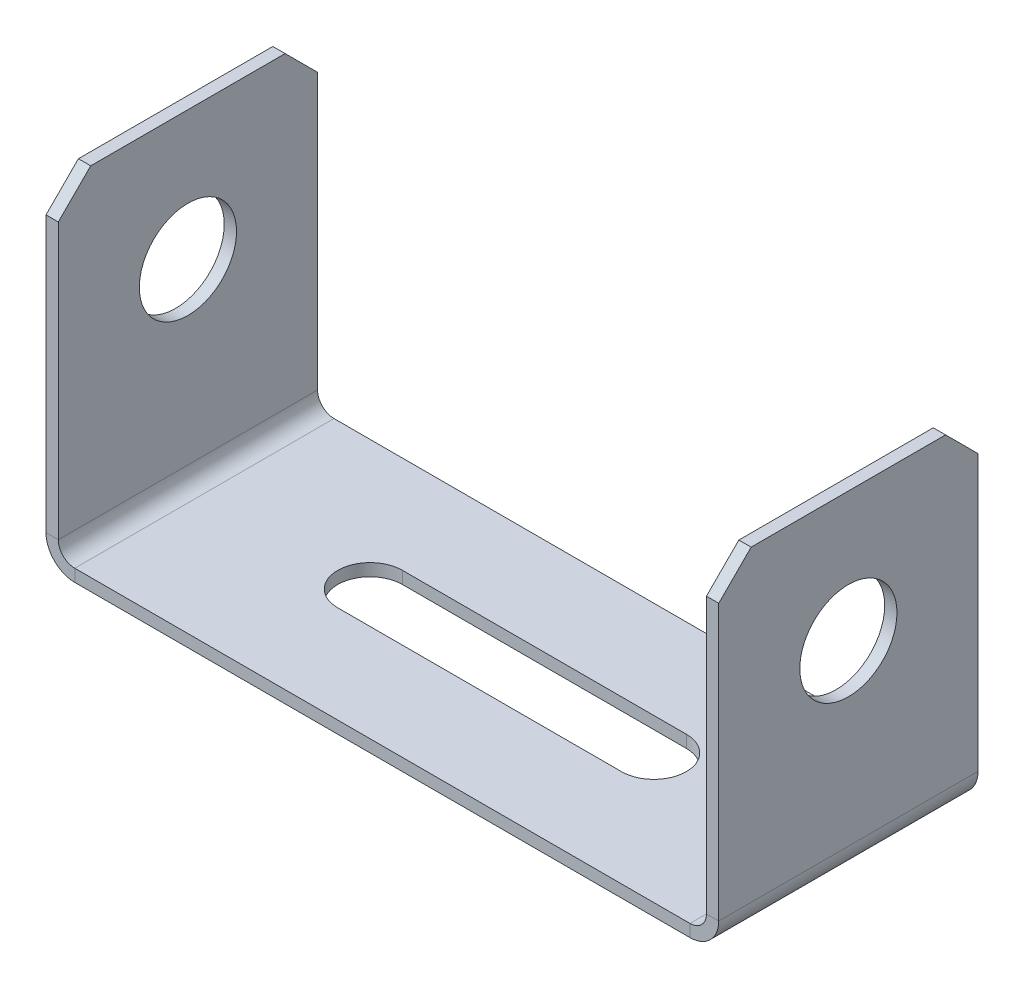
ISO-10303-21;
HEADER;
FILE_DESCRIPTION(('STEP AP214'),'2;1');
FILE_NAME('part.step','',(''),(''),'','','');
FILE_SCHEMA(('AUTOMOTIVE_DESIGN { 1 0 10303 214 1 1 1 1 }'));
ENDSEC;
DATA;
#1=APPLICATION_CONTEXT('core data for automotive mechanical design processes');
#2=APPLICATION_PROTOCOL_DEFINITION('international standard','automotive_design',2000,#1);
#3=PRODUCT_CONTEXT('',#1,'mechanical');
#4=PRODUCT('Part','Part','',(#3));
#5=PRODUCT_RELATED_PRODUCT_CATEGORY('part','',(#4));
#6=PRODUCT_DEFINITION_FORMATION('','',#4);
#7=PRODUCT_DEFINITION_CONTEXT('part definition',#1,'design');
#8=PRODUCT_DEFINITION('design','',#6,#7);
#9=PRODUCT_DEFINITION_SHAPE('','',#8);
#10=(LENGTH_UNIT() NAMED_UNIT(*) SI_UNIT(.MILLI.,.METRE.));
#11=(NAMED_UNIT(*) PLANE_ANGLE_UNIT() SI_UNIT($,.RADIAN.));
#12=(NAMED_UNIT(*) SI_UNIT($,.STERADIAN.) SOLID_ANGLE_UNIT());
#13=UNCERTAINTY_MEASURE_WITH_UNIT(LENGTH_MEASURE(1.E-05),#10,'distance_accuracy_value','');
#14=(GEOMETRIC_REPRESENTATION_CONTEXT(3) GLOBAL_UNCERTAINTY_ASSIGNED_CONTEXT((#13)) GLOBAL_UNIT_ASSIGNED_CONTEXT((#10,
#11,#12)) REPRESENTATION_CONTEXT('',''));
#15=CARTESIAN_POINT('',(0.,0.,0.));
#16=DIRECTION('',(0.,0.,1.));
#17=DIRECTION('',(1.,0.,0.));
#18=AXIS2_PLACEMENT_3D('',#15,#16,#17);
#19=CARTESIAN_POINT('',(-47.46,0.,20.));
#20=DIRECTION('',(0.,0.,1.));
#21=DIRECTION('',(1.,0.,0.));
#22=AXIS2_PLACEMENT_3D('',#19,#20,#21);
#23=PLANE('',#22);
#24=DIRECTION('',(0.,-1.,0.));
#25=VECTOR('',#24,1.);
#26=CARTESIAN_POINT('',(-47.46,0.,20.));
#27=LINE('',#26,#25);
#28=CARTESIAN_POINT('',(-47.46,0.,20.));
#29=VERTEX_POINT('',#28);
#30=CARTESIAN_POINT('',(-47.46,-1.89738,20.));
#31=VERTEX_POINT('',#30);
#32=EDGE_CURVE('E325',#29,#31,#27,.T.);
#33=ORIENTED_EDGE('',*,*,#32,.F.);
#34=CARTESIAN_POINT('',(-47.46,2.54,20.));
#35=DIRECTION('',(0.,0.,-1.));
#36=DIRECTION('',(-1.,0.,0.));
#37=AXIS2_PLACEMENT_3D('',#34,#35,#36);
#38=CIRCLE('',#37,2.54);
#39=CARTESIAN_POINT('',(-50.,2.54,20.));
#40=VERTEX_POINT('',#39);
#41=EDGE_CURVE('E246',#29,#40,#38,.T.);
#42=ORIENTED_EDGE('',*,*,#41,.T.);
#43=DIRECTION('',(1.,0.,0.));
#44=VECTOR('',#43,1.);
#45=CARTESIAN_POINT('',(-51.89738,2.54,20.));
#46=LINE('',#45,#44);
#47=CARTESIAN_POINT('',(-51.89738,2.54,20.));
#48=VERTEX_POINT('',#47);
#49=EDGE_CURVE('E323',#48,#40,#46,.T.);
#50=ORIENTED_EDGE('',*,*,#49,.F.);
#51=CARTESIAN_POINT('',(-47.46,2.54,20.));
#52=DIRECTION('',(0.,0.,1.));
#53=DIRECTION('',(1.,0.,0.));
#54=AXIS2_PLACEMENT_3D('',#51,#52,#53);
#55=CIRCLE('',#54,4.43738);
#56=EDGE_CURVE('E227',#31,#48,#55,.F.);
#57=ORIENTED_EDGE('',*,*,#56,.F.);
#58=EDGE_LOOP('',(#33,#42,#50,#57));
#59=FACE_BOUND('',#58,.T.);
#60=ADVANCED_FACE('F36',(#59),#23,.T.);
#61=CARTESIAN_POINT('',(-51.89738,2.54,20.));
#62=DIRECTION('',(0.,0.,1.));
#63=DIRECTION('',(1.,0.,0.));
#64=AXIS2_PLACEMENT_3D('',#61,#62,#63);
#65=PLANE('',#64);
#66=DIRECTION('',(-1.,0.,0.));
#67=VECTOR('',#66,1.);
#68=CARTESIAN_POINT('',(-50.,0.,20.));
#69=LINE('',#68,#67);
#70=CARTESIAN_POINT('',(47.46,0.,20.));
#71=VERTEX_POINT('',#70);
#72=EDGE_CURVE('E243',#71,#29,#69,.T.);
#73=ORIENTED_EDGE('',*,*,#72,.T.);
#74=ORIENTED_EDGE('',*,*,#32,.T.);
#75=DIRECTION('',(1.,0.,0.));
#76=VECTOR('',#75,1.);
#77=CARTESIAN_POINT('',(-50.,-1.89738,20.));
#78=LINE('',#77,#76);
#79=CARTESIAN_POINT('',(47.46,-1.89738,20.));
#80=VERTEX_POINT('',#79);
#81=EDGE_CURVE('E230',#80,#31,#78,.F.);
#82=ORIENTED_EDGE('',*,*,#81,.F.);
#83=DIRECTION('',(0.,1.,0.));
#84=VECTOR('',#83,1.);
#85=CARTESIAN_POINT('',(47.46,-1.89738,20.));
#86=LINE('',#85,#84);
#87=EDGE_CURVE('E314',#80,#71,#86,.T.);
#88=ORIENTED_EDGE('',*,*,#87,.T.);
#89=EDGE_LOOP('',(#73,#74,#82,#88));
#90=FACE_BOUND('',#89,.T.);
#91=ADVANCED_FACE('F417',(#90),#65,.T.);
#92=CARTESIAN_POINT('',(-50.,2.54,-20.));
#93=DIRECTION('',(0.,0.,-1.));
#94=DIRECTION('',(-1.,0.,0.));
#95=AXIS2_PLACEMENT_3D('',#92,#93,#94);
#96=PLANE('',#95);
#97=DIRECTION('',(-1.,0.,0.));
#98=VECTOR('',#97,1.);
#99=CARTESIAN_POINT('',(-50.,2.54,-20.));
#100=LINE('',#99,#98);
#101=CARTESIAN_POINT('',(-50.,2.54,-20.));
#102=VERTEX_POINT('',#101);
#103=CARTESIAN_POINT('',(-51.89738,2.54,-20.));
#104=VERTEX_POINT('',#103);
#105=EDGE_CURVE('E321',#102,#104,#100,.T.);
#106=ORIENTED_EDGE('',*,*,#105,.F.);
#107=CARTESIAN_POINT('',(-47.46,2.54,-20.));
#108=DIRECTION('',(0.,0.,-1.));
#109=DIRECTION('',(-1.,0.,0.));
#110=AXIS2_PLACEMENT_3D('',#107,#108,#109);
#111=CIRCLE('',#110,2.54);
#112=CARTESIAN_POINT('',(-47.46,0.,-20.));
#113=VERTEX_POINT('',#112);
#114=EDGE_CURVE('E225',#113,#102,#111,.T.);
#115=ORIENTED_EDGE('',*,*,#114,.F.);
#116=DIRECTION('',(0.,1.,0.));
#117=VECTOR('',#116,1.);
#118=CARTESIAN_POINT('',(-47.46,-1.89738,-20.));
#119=LINE('',#118,#117);
#120=CARTESIAN_POINT('',(-47.46,-1.89738,-20.));
#121=VERTEX_POINT('',#120);
#122=EDGE_CURVE('E319',#121,#113,#119,.T.);
#123=ORIENTED_EDGE('',*,*,#122,.F.);
#124=CARTESIAN_POINT('',(-47.46,2.54,-20.));
#125=DIRECTION('',(0.,0.,1.));
#126=DIRECTION('',(1.,0.,0.));
#127=AXIS2_PLACEMENT_3D('',#124,#125,#126);
#128=CIRCLE('',#127,4.43738);
#129=EDGE_CURVE('E255',#121,#104,#128,.F.);
#130=ORIENTED_EDGE('',*,*,#129,.T.);
#131=EDGE_LOOP('',(#106,#115,#123,#130));
#132=FACE_BOUND('',#131,.T.);
#133=ADVANCED_FACE('F390',(#132),#96,.T.);
#134=CARTESIAN_POINT('',(-47.46,-1.89738,-20.));
#135=DIRECTION('',(0.,0.,-1.));
#136=DIRECTION('',(-1.,0.,0.));
#137=AXIS2_PLACEMENT_3D('',#134,#135,#136);
#138=PLANE('',#137);
#139=DIRECTION('',(0.,1.,0.));
#140=VECTOR('',#139,1.);
#141=CARTESIAN_POINT('',(-51.89738,50.,-20.));
#142=LINE('',#141,#140);
#143=CARTESIAN_POINT('',(-51.89738,45.,-20.));
#144=VERTEX_POINT('',#143);
#145=EDGE_CURVE('E252',#104,#144,#142,.T.);
#146=ORIENTED_EDGE('',*,*,#145,.T.);
#147=DIRECTION('',(1.,0.,0.));
#148=VECTOR('',#147,1.);
#149=CARTESIAN_POINT('',(-47.46,45.,-20.));
#150=LINE('',#149,#148);
#151=CARTESIAN_POINT('',(-50.,45.,-20.));
#152=VERTEX_POINT('',#151);
#153=EDGE_CURVE('E349',#144,#152,#150,.T.);
#154=ORIENTED_EDGE('',*,*,#153,.T.);
#155=DIRECTION('',(0.,1.,0.));
#156=VECTOR('',#155,1.);
#157=CARTESIAN_POINT('',(-50.,50.,-20.));
#158=LINE('',#157,#156);
#159=EDGE_CURVE('E218',#102,#152,#158,.T.);
#160=ORIENTED_EDGE('',*,*,#159,.F.);
#161=ORIENTED_EDGE('',*,*,#105,.T.);
#162=EDGE_LOOP('',(#146,#154,#160,#161));
#163=FACE_BOUND('',#162,.T.);
#164=ADVANCED_FACE('F369',(#163),#138,.T.);
#165=CARTESIAN_POINT('',(50.,2.54,20.));
#166=DIRECTION('',(0.,0.,1.));
#167=DIRECTION('',(1.,0.,0.));
#168=AXIS2_PLACEMENT_3D('',#165,#166,#167);
#169=PLANE('',#168);
#170=DIRECTION('',(1.,0.,0.));
#171=VECTOR('',#170,1.);
#172=CARTESIAN_POINT('',(50.,2.54,20.));
#173=LINE('',#172,#171);
#174=CARTESIAN_POINT('',(50.,2.54,20.));
#175=VERTEX_POINT('',#174);
#176=CARTESIAN_POINT('',(51.89738,2.54,20.));
#177=VERTEX_POINT('',#176);
#178=EDGE_CURVE('E316',#175,#177,#173,.T.);
#179=ORIENTED_EDGE('',*,*,#178,.F.);
#180=CARTESIAN_POINT('',(47.46,2.54,20.));
#181=DIRECTION('',(0.,0.,-1.));
#182=DIRECTION('',(-1.,0.,0.));
#183=AXIS2_PLACEMENT_3D('',#180,#181,#182);
#184=CIRCLE('',#183,2.54);
#185=EDGE_CURVE('E240',#175,#71,#184,.T.);
#186=ORIENTED_EDGE('',*,*,#185,.T.);
#187=ORIENTED_EDGE('',*,*,#87,.F.);
#188=CARTESIAN_POINT('',(47.46,2.54,20.));
#189=DIRECTION('',(0.,0.,1.));
#190=DIRECTION('',(1.,0.,0.));
#191=AXIS2_PLACEMENT_3D('',#188,#189,#190);
#192=CIRCLE('',#191,4.43738);
#193=EDGE_CURVE('E233',#177,#80,#192,.F.);
#194=ORIENTED_EDGE('',*,*,#193,.F.);
#195=EDGE_LOOP('',(#179,#186,#187,#194));
#196=FACE_BOUND('',#195,.T.);
#197=ADVANCED_FACE('F412',(#196),#169,.T.);
#198=CARTESIAN_POINT('',(47.46,-1.89738,20.));
#199=DIRECTION('',(0.,0.,1.));
#200=DIRECTION('',(1.,0.,0.));
#201=AXIS2_PLACEMENT_3D('',#198,#199,#200);
#202=PLANE('',#201);
#203=DIRECTION('',(0.,-1.,0.));
#204=VECTOR('',#203,1.);
#205=CARTESIAN_POINT('',(51.89738,50.,20.));
#206=LINE('',#205,#204);
#207=CARTESIAN_POINT('',(51.89738,45.,20.));
#208=VERTEX_POINT('',#207);
#209=EDGE_CURVE('E236',#208,#177,#206,.T.);
#210=ORIENTED_EDGE('',*,*,#209,.F.);
#211=DIRECTION('',(-1.,0.,0.));
#212=VECTOR('',#211,1.);
#213=CARTESIAN_POINT('',(47.46,45.,20.));
#214=LINE('',#213,#212);
#215=CARTESIAN_POINT('',(50.,45.,20.));
#216=VERTEX_POINT('',#215);
#217=EDGE_CURVE('E347',#208,#216,#214,.T.);
#218=ORIENTED_EDGE('',*,*,#217,.T.);
#219=DIRECTION('',(0.,-1.,0.));
#220=VECTOR('',#219,1.);
#221=CARTESIAN_POINT('',(50.,50.,20.));
#222=LINE('',#221,#220);
#223=EDGE_CURVE('E238',#216,#175,#222,.T.);
#224=ORIENTED_EDGE('',*,*,#223,.T.);
#225=ORIENTED_EDGE('',*,*,#178,.T.);
#226=EDGE_LOOP('',(#210,#218,#224,#225));
#227=FACE_BOUND('',#226,.T.);
#228=ADVANCED_FACE('F439',(#227),#202,.T.);
#229=CARTESIAN_POINT('',(47.46,0.,-20.));
#230=DIRECTION('',(0.,0.,-1.));
#231=DIRECTION('',(-1.,0.,0.));
#232=AXIS2_PLACEMENT_3D('',#229,#230,#231);
#233=PLANE('',#232);
#234=DIRECTION('',(0.,-1.,0.));
#235=VECTOR('',#234,1.);
#236=CARTESIAN_POINT('',(47.46,0.,-20.));
#237=LINE('',#236,#235);
#238=CARTESIAN_POINT('',(47.46,0.,-20.));
#239=VERTEX_POINT('',#238);
#240=CARTESIAN_POINT('',(47.46,-1.89738,-20.));
#241=VERTEX_POINT('',#240);
#242=EDGE_CURVE('E312',#239,#241,#237,.T.);
#243=ORIENTED_EDGE('',*,*,#242,.F.);
#244=CARTESIAN_POINT('',(47.46,2.54,-20.));
#245=DIRECTION('',(0.,0.,-1.));
#246=DIRECTION('',(-1.,0.,0.));
#247=AXIS2_PLACEMENT_3D('',#244,#245,#246);
#248=CIRCLE('',#247,2.54);
#249=CARTESIAN_POINT('',(50.,2.54,-20.));
#250=VERTEX_POINT('',#249);
#251=EDGE_CURVE('E268',#250,#239,#248,.T.);
#252=ORIENTED_EDGE('',*,*,#251,.F.);
#253=DIRECTION('',(-1.,0.,0.));
#254=VECTOR('',#253,1.);
#255=CARTESIAN_POINT('',(51.89738,2.54,-20.));
#256=LINE('',#255,#254);
#257=CARTESIAN_POINT('',(51.89738,2.54,-20.));
#258=VERTEX_POINT('',#257);
#259=EDGE_CURVE('E309',#258,#250,#256,.T.);
#260=ORIENTED_EDGE('',*,*,#259,.F.);
#261=CARTESIAN_POINT('',(47.46,2.54,-20.));
#262=DIRECTION('',(0.,0.,1.));
#263=DIRECTION('',(1.,0.,0.));
#264=AXIS2_PLACEMENT_3D('',#261,#262,#263);
#265=CIRCLE('',#264,4.43738);
#266=EDGE_CURVE('E261',#258,#241,#265,.F.);
#267=ORIENTED_EDGE('',*,*,#266,.T.);
#268=EDGE_LOOP('',(#243,#252,#260,#267));
#269=FACE_BOUND('',#268,.T.);
#270=ADVANCED_FACE('F404',(#269),#233,.T.);
#271=CARTESIAN_POINT('',(51.89738,2.54,-20.));
#272=DIRECTION('',(0.,0.,-1.));
#273=DIRECTION('',(-1.,0.,0.));
#274=AXIS2_PLACEMENT_3D('',#271,#272,#273);
#275=PLANE('',#274);
#276=DIRECTION('',(-1.,0.,0.));
#277=VECTOR('',#276,1.);
#278=CARTESIAN_POINT('',(-50.,0.,-20.));
#279=LINE('',#278,#277);
#280=EDGE_CURVE('E271',#239,#113,#279,.T.);
#281=ORIENTED_EDGE('',*,*,#280,.F.);
#282=ORIENTED_EDGE('',*,*,#242,.T.);
#283=DIRECTION('',(1.,0.,0.));
#284=VECTOR('',#283,1.);
#285=CARTESIAN_POINT('',(-50.,-1.89738,-20.));
#286=LINE('',#285,#284);
#287=EDGE_CURVE('E258',#241,#121,#286,.F.);
#288=ORIENTED_EDGE('',*,*,#287,.T.);
#289=ORIENTED_EDGE('',*,*,#122,.T.);
#290=EDGE_LOOP('',(#281,#282,#288,#289));
#291=FACE_BOUND('',#290,.T.);
#292=ADVANCED_FACE('F398',(#291),#275,.T.);
#293=CARTESIAN_POINT('',(-50.,50.,20.));
#294=DIRECTION('',(-1.,0.,0.));
#295=DIRECTION('',(0.,-1.,0.));
#296=AXIS2_PLACEMENT_3D('',#293,#294,#295);
#297=PLANE('',#296);
#298=CARTESIAN_POINT('',(-50.,30.,0.));
#299=DIRECTION('',(-1.,0.,0.));
#300=DIRECTION('',(0.,-1.,0.));
#301=AXIS2_PLACEMENT_3D('',#298,#299,#300);
#302=CIRCLE('',#301,7.5);
#303=CARTESIAN_POINT('',(-50.,22.5,0.));
#304=VERTEX_POINT('',#303);
#305=EDGE_CURVE('E206',#304,#304,#302,.T.);
#306=ORIENTED_EDGE('',*,*,#305,.T.);
#307=EDGE_LOOP('',(#306));
#308=FACE_BOUND('',#307,.T.);
#309=ORIENTED_EDGE('',*,*,#159,.T.);
#310=DIRECTION('',(0.,-0.707106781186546,-0.707106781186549));
#311=VECTOR('',#310,1.);
#312=CARTESIAN_POINT('',(-50.,45.,-20.));
#313=LINE('',#312,#311);
#314=CARTESIAN_POINT('',(-50.,50.,-15.));
#315=VERTEX_POINT('',#314);
#316=EDGE_CURVE('E354',#152,#315,#313,.F.);
#317=ORIENTED_EDGE('',*,*,#316,.T.);
#318=DIRECTION('',(0.,0.,-1.));
#319=VECTOR('',#318,1.);
#320=CARTESIAN_POINT('',(-50.,50.,20.));
#321=LINE('',#320,#319);
#322=CARTESIAN_POINT('',(-50.,50.,15.));
#323=VERTEX_POINT('',#322);
#324=EDGE_CURVE('E307',#323,#315,#321,.T.);
#325=ORIENTED_EDGE('',*,*,#324,.F.);
#326=DIRECTION('',(0.,0.70710678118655,-0.707106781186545));
#327=VECTOR('',#326,1.);
#328=CARTESIAN_POINT('',(-50.,50.,15.));
#329=LINE('',#328,#327);
#330=CARTESIAN_POINT('',(-50.,45.,20.));
#331=VERTEX_POINT('',#330);
#332=EDGE_CURVE('E352',#323,#331,#329,.F.);
#333=ORIENTED_EDGE('',*,*,#332,.T.);
#334=DIRECTION('',(0.,1.,0.));
#335=VECTOR('',#334,1.);
#336=CARTESIAN_POINT('',(-50.,50.,20.));
#337=LINE('',#336,#335);
#338=EDGE_CURVE('E222',#40,#331,#337,.T.);
#339=ORIENTED_EDGE('',*,*,#338,.F.);
#340=DIRECTION('',(0.,0.,-1.));
#341=VECTOR('',#340,1.);
#342=CARTESIAN_POINT('',(-50.,2.54,20.));
#343=LINE('',#342,#341);
#344=EDGE_CURVE('E249',#40,#102,#343,.T.);
#345=ORIENTED_EDGE('',*,*,#344,.T.);
#346=EDGE_LOOP('',(#309,#317,#325,#333,#339,#345));
#347=FACE_BOUND('',#346,.T.);
#348=ADVANCED_FACE('F374',(#308,#347),#297,.F.);
#349=CARTESIAN_POINT('',(-51.89738,50.,20.));
#350=DIRECTION('',(0.,1.,0.));
#351=DIRECTION('',(0.,0.,1.));
#352=AXIS2_PLACEMENT_3D('',#349,#350,#351);
#353=PLANE('',#352);
#354=ORIENTED_EDGE('',*,*,#324,.T.);
#355=DIRECTION('',(-1.,0.,0.));
#356=VECTOR('',#355,1.);
#357=CARTESIAN_POINT('',(-51.89738,50.,-15.));
#358=LINE('',#357,#356);
#359=CARTESIAN_POINT('',(-51.89738,50.,-15.));
#360=VERTEX_POINT('',#359);
#361=EDGE_CURVE('E57',#315,#360,#358,.T.);
#362=ORIENTED_EDGE('',*,*,#361,.T.);
#363=DIRECTION('',(0.,0.,-1.));
#364=VECTOR('',#363,1.);
#365=CARTESIAN_POINT('',(-51.89738,50.,20.));
#366=LINE('',#365,#364);
#367=CARTESIAN_POINT('',(-51.89738,50.,15.));
#368=VERTEX_POINT('',#367);
#369=EDGE_CURVE('E305',#368,#360,#366,.T.);
#370=ORIENTED_EDGE('',*,*,#369,.F.);
#371=DIRECTION('',(1.,0.,0.));
#372=VECTOR('',#371,1.);
#373=CARTESIAN_POINT('',(-51.89738,50.,15.));
#374=LINE('',#373,#372);
#375=EDGE_CURVE('E356',#368,#323,#374,.T.);
#376=ORIENTED_EDGE('',*,*,#375,.T.);
#377=EDGE_LOOP('',(#354,#362,#370,#376));
#378=FACE_BOUND('',#377,.T.);
#379=ADVANCED_FACE('F375',(#378),#353,.T.);
#380=CARTESIAN_POINT('',(-51.89738,50.,20.));
#381=DIRECTION('',(-1.,0.,0.));
#382=DIRECTION('',(0.,-1.,0.));
#383=AXIS2_PLACEMENT_3D('',#380,#381,#382);
#384=PLANE('',#383);
#385=CARTESIAN_POINT('',(-51.89738,30.,0.));
#386=DIRECTION('',(1.,0.,0.));
#387=DIRECTION('',(0.,0.,-1.));
#388=AXIS2_PLACEMENT_3D('',#385,#386,#387);
#389=CIRCLE('',#388,7.5);
#390=CARTESIAN_POINT('',(-51.89738,30.,-7.5));
#391=VERTEX_POINT('',#390);
#392=EDGE_CURVE('E331',#391,#391,#389,.T.);
#393=ORIENTED_EDGE('',*,*,#392,.T.);
#394=EDGE_LOOP('',(#393));
#395=FACE_BOUND('',#394,.T.);
#396=ORIENTED_EDGE('',*,*,#369,.T.);
#397=DIRECTION('',(0.,0.707106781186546,0.707106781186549));
#398=VECTOR('',#397,1.);
#399=CARTESIAN_POINT('',(-51.89738,67.5,2.50000000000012));
#400=LINE('',#399,#398);
#401=EDGE_CURVE('E44',#360,#144,#400,.F.);
#402=ORIENTED_EDGE('',*,*,#401,.T.);
#403=ORIENTED_EDGE('',*,*,#145,.F.);
#404=DIRECTION('',(0.,0.,-1.));
#405=VECTOR('',#404,1.);
#406=CARTESIAN_POINT('',(-51.89738,2.54,20.));
#407=LINE('',#406,#405);
#408=EDGE_CURVE('E302',#48,#104,#407,.T.);
#409=ORIENTED_EDGE('',*,*,#408,.F.);
#410=DIRECTION('',(0.,1.,0.));
#411=VECTOR('',#410,1.);
#412=CARTESIAN_POINT('',(-51.89738,50.,20.));
#413=LINE('',#412,#411);
#414=CARTESIAN_POINT('',(-51.89738,45.,20.));
#415=VERTEX_POINT('',#414);
#416=EDGE_CURVE('E224',#48,#415,#413,.T.);
#417=ORIENTED_EDGE('',*,*,#416,.T.);
#418=DIRECTION('',(0.,-0.70710678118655,0.707106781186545));
#419=VECTOR('',#418,1.);
#420=CARTESIAN_POINT('',(-51.89738,47.5,17.5));
#421=LINE('',#420,#419);
#422=EDGE_CURVE('E360',#415,#368,#421,.F.);
#423=ORIENTED_EDGE('',*,*,#422,.T.);
#424=EDGE_LOOP('',(#396,#402,#403,#409,#417,#423));
#425=FACE_BOUND('',#424,.T.);
#426=ADVANCED_FACE('F364',(#395,#425),#384,.T.);
#427=CARTESIAN_POINT('',(-47.46,2.54,20.));
#428=DIRECTION('',(0.,0.,-1.));
#429=DIRECTION('',(-1.,0.,0.));
#430=AXIS2_PLACEMENT_3D('',#427,#428,#429);
#431=CYLINDRICAL_SURFACE('',#430,4.43738);
#432=ORIENTED_EDGE('',*,*,#129,.F.);
#433=DIRECTION('',(0.,0.,-1.));
#434=VECTOR('',#433,1.);
#435=CARTESIAN_POINT('',(-47.46,-1.89738,20.));
#436=LINE('',#435,#434);
#437=EDGE_CURVE('E299',#31,#121,#436,.T.);
#438=ORIENTED_EDGE('',*,*,#437,.F.);
#439=ORIENTED_EDGE('',*,*,#56,.T.);
#440=ORIENTED_EDGE('',*,*,#408,.T.);
#441=EDGE_LOOP('',(#432,#438,#439,#440));
#442=FACE_BOUND('',#441,.T.);
#443=ADVANCED_FACE('F394',(#442),#431,.T.);
#444=CARTESIAN_POINT('',(-50.,-1.89738,20.));
#445=DIRECTION('',(0.,-1.,0.));
#446=DIRECTION('',(0.,0.,-1.));
#447=AXIS2_PLACEMENT_3D('',#444,#445,#446);
#448=PLANE('',#447);
#449=CARTESIAN_POINT('',(-21.89738,-1.89738,0.));
#450=DIRECTION('',(0.,1.,0.));
#451=DIRECTION('',(0.,0.,1.));
#452=AXIS2_PLACEMENT_3D('',#449,#450,#451);
#453=CIRCLE('',#452,5.);
#454=CARTESIAN_POINT('',(-21.89738,-1.89738,-5.));
#455=VERTEX_POINT('',#454);
#456=CARTESIAN_POINT('',(-21.89738,-1.89738,5.));
#457=VERTEX_POINT('',#456);
#458=EDGE_CURVE('E179',#455,#457,#453,.T.);
#459=ORIENTED_EDGE('',*,*,#458,.T.);
#460=DIRECTION('',(1.,0.,0.));
#461=VECTOR('',#460,1.);
#462=CARTESIAN_POINT('',(-21.89738,-1.89738,5.));
#463=LINE('',#462,#461);
#464=CARTESIAN_POINT('',(21.89738,-1.89738,4.99999999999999));
#465=VERTEX_POINT('',#464);
#466=EDGE_CURVE('E191',#457,#465,#463,.T.);
#467=ORIENTED_EDGE('',*,*,#466,.T.);
#468=CARTESIAN_POINT('',(21.89738,-1.89738,0.));
#469=DIRECTION('',(0.,1.,0.));
#470=DIRECTION('',(0.,0.,1.));
#471=AXIS2_PLACEMENT_3D('',#468,#469,#470);
#472=CIRCLE('',#471,5.);
#473=CARTESIAN_POINT('',(21.89738,-1.89738,-5.00000000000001));
#474=VERTEX_POINT('',#473);
#475=EDGE_CURVE('E195',#465,#474,#472,.T.);
#476=ORIENTED_EDGE('',*,*,#475,.T.);
#477=DIRECTION('',(-1.,0.,0.));
#478=VECTOR('',#477,1.);
#479=CARTESIAN_POINT('',(-21.89738,-1.89738,-5.));
#480=LINE('',#479,#478);
#481=EDGE_CURVE('E187',#474,#455,#480,.T.);
#482=ORIENTED_EDGE('',*,*,#481,.T.);
#483=EDGE_LOOP('',(#459,#467,#476,#482));
#484=FACE_BOUND('',#483,.T.);
#485=ORIENTED_EDGE('',*,*,#287,.F.);
#486=DIRECTION('',(0.,0.,-1.));
#487=VECTOR('',#486,1.);
#488=CARTESIAN_POINT('',(47.46,-1.89738,20.));
#489=LINE('',#488,#487);
#490=EDGE_CURVE('E296',#80,#241,#489,.T.);
#491=ORIENTED_EDGE('',*,*,#490,.F.);
#492=ORIENTED_EDGE('',*,*,#81,.T.);
#493=ORIENTED_EDGE('',*,*,#437,.T.);
#494=EDGE_LOOP('',(#485,#491,#492,#493));
#495=FACE_BOUND('',#494,.T.);
#496=ADVANCED_FACE('F197',(#484,#495),#448,.T.);
#497=CARTESIAN_POINT('',(47.46,2.54,20.));
#498=DIRECTION('',(0.,0.,-1.));
#499=DIRECTION('',(-1.,0.,0.));
#500=AXIS2_PLACEMENT_3D('',#497,#498,#499);
#501=CYLINDRICAL_SURFACE('',#500,4.43738);
#502=ORIENTED_EDGE('',*,*,#266,.F.);
#503=DIRECTION('',(0.,0.,-1.));
#504=VECTOR('',#503,1.);
#505=CARTESIAN_POINT('',(51.89738,2.54,20.));
#506=LINE('',#505,#504);
#507=EDGE_CURVE('E293',#177,#258,#506,.T.);
#508=ORIENTED_EDGE('',*,*,#507,.F.);
#509=ORIENTED_EDGE('',*,*,#193,.T.);
#510=ORIENTED_EDGE('',*,*,#490,.T.);
#511=EDGE_LOOP('',(#502,#508,#509,#510));
#512=FACE_BOUND('',#511,.T.);
#513=ADVANCED_FACE('F408',(#512),#501,.T.);
#514=CARTESIAN_POINT('',(51.89738,50.,20.));
#515=DIRECTION('',(1.,0.,0.));
#516=DIRECTION('',(0.,1.,0.));
#517=AXIS2_PLACEMENT_3D('',#514,#515,#516);
#518=PLANE('',#517);
#519=CARTESIAN_POINT('',(51.89738,30.,0.));
#520=DIRECTION('',(1.,0.,0.));
#521=DIRECTION('',(0.,0.,-1.));
#522=AXIS2_PLACEMENT_3D('',#519,#520,#521);
#523=CIRCLE('',#522,7.5);
#524=CARTESIAN_POINT('',(51.89738,30.,-7.5));
#525=VERTEX_POINT('',#524);
#526=EDGE_CURVE('E776',#525,#525,#523,.T.);
#527=ORIENTED_EDGE('',*,*,#526,.F.);
#528=EDGE_LOOP('',(#527));
#529=FACE_BOUND('',#528,.T.);
#530=DIRECTION('',(0.,-1.,0.));
#531=VECTOR('',#530,1.);
#532=CARTESIAN_POINT('',(51.89738,50.,-20.));
#533=LINE('',#532,#531);
#534=CARTESIAN_POINT('',(51.89738,45.,-20.));
#535=VERTEX_POINT('',#534);
#536=EDGE_CURVE('E264',#535,#258,#533,.T.);
#537=ORIENTED_EDGE('',*,*,#536,.F.);
#538=DIRECTION('',(0.,0.707106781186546,0.707106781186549));
#539=VECTOR('',#538,1.);
#540=CARTESIAN_POINT('',(51.89738,67.5,2.50000000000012));
#541=LINE('',#540,#539);
#542=CARTESIAN_POINT('',(51.89738,50.,-15.));
#543=VERTEX_POINT('',#542);
#544=EDGE_CURVE('E336',#535,#543,#541,.T.);
#545=ORIENTED_EDGE('',*,*,#544,.T.);
#546=DIRECTION('',(0.,0.,-1.));
#547=VECTOR('',#546,1.);
#548=CARTESIAN_POINT('',(51.89738,50.,20.));
#549=LINE('',#548,#547);
#550=CARTESIAN_POINT('',(51.89738,50.,15.));
#551=VERTEX_POINT('',#550);
#552=EDGE_CURVE('E290',#551,#543,#549,.T.);
#553=ORIENTED_EDGE('',*,*,#552,.F.);
#554=DIRECTION('',(0.,0.707106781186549,-0.707106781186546));
#555=VECTOR('',#554,1.);
#556=CARTESIAN_POINT('',(51.89738,47.5,17.5));
#557=LINE('',#556,#555);
#558=EDGE_CURVE('E334',#551,#208,#557,.F.);
#559=ORIENTED_EDGE('',*,*,#558,.T.);
#560=ORIENTED_EDGE('',*,*,#209,.T.);
#561=ORIENTED_EDGE('',*,*,#507,.T.);
#562=EDGE_LOOP('',(#537,#545,#553,#559,#560,#561));
#563=FACE_BOUND('',#562,.T.);
#564=ADVANCED_FACE('F434',(#529,#563),#518,.T.);
#565=CARTESIAN_POINT('',(50.,50.,20.));
#566=DIRECTION('',(0.,1.,0.));
#567=DIRECTION('',(0.,0.,1.));
#568=AXIS2_PLACEMENT_3D('',#565,#566,#567);
#569=PLANE('',#568);
#570=ORIENTED_EDGE('',*,*,#552,.T.);
#571=DIRECTION('',(-1.,0.,0.));
#572=VECTOR('',#571,1.);
#573=CARTESIAN_POINT('',(50.,50.,-15.));
#574=LINE('',#573,#572);
#575=CARTESIAN_POINT('',(50.,50.,-15.));
#576=VERTEX_POINT('',#575);
#577=EDGE_CURVE('E341',#543,#576,#574,.T.);
#578=ORIENTED_EDGE('',*,*,#577,.T.);
#579=DIRECTION('',(0.,0.,-1.));
#580=VECTOR('',#579,1.);
#581=CARTESIAN_POINT('',(50.,50.,20.));
#582=LINE('',#581,#580);
#583=CARTESIAN_POINT('',(50.,50.,15.));
#584=VERTEX_POINT('',#583);
#585=EDGE_CURVE('E287',#584,#576,#582,.T.);
#586=ORIENTED_EDGE('',*,*,#585,.F.);
#587=DIRECTION('',(1.,0.,0.));
#588=VECTOR('',#587,1.);
#589=CARTESIAN_POINT('',(50.,50.,15.));
#590=LINE('',#589,#588);
#591=EDGE_CURVE('E338',#584,#551,#590,.T.);
#592=ORIENTED_EDGE('',*,*,#591,.T.);
#593=EDGE_LOOP('',(#570,#578,#586,#592));
#594=FACE_BOUND('',#593,.T.);
#595=ADVANCED_FACE('F445',(#594),#569,.T.);
#596=CARTESIAN_POINT('',(50.,50.,20.));
#597=DIRECTION('',(1.,0.,0.));
#598=DIRECTION('',(0.,1.,0.));
#599=AXIS2_PLACEMENT_3D('',#596,#597,#598);
#600=PLANE('',#599);
#601=CARTESIAN_POINT('',(50.,30.,0.));
#602=DIRECTION('',(1.,0.,0.));
#603=DIRECTION('',(0.,1.,0.));
#604=AXIS2_PLACEMENT_3D('',#601,#602,#603);
#605=CIRCLE('',#604,7.5);
#606=CARTESIAN_POINT('',(50.,37.5,0.));
#607=VERTEX_POINT('',#606);
#608=EDGE_CURVE('E328',#607,#607,#605,.T.);
#609=ORIENTED_EDGE('',*,*,#608,.T.);
#610=EDGE_LOOP('',(#609));
#611=FACE_BOUND('',#610,.T.);
#612=ORIENTED_EDGE('',*,*,#585,.T.);
#613=DIRECTION('',(0.,-0.707106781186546,-0.707106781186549));
#614=VECTOR('',#613,1.);
#615=CARTESIAN_POINT('',(50.,45.,-20.));
#616=LINE('',#615,#614);
#617=CARTESIAN_POINT('',(50.,45.,-20.));
#618=VERTEX_POINT('',#617);
#619=EDGE_CURVE('E345',#576,#618,#616,.T.);
#620=ORIENTED_EDGE('',*,*,#619,.T.);
#621=DIRECTION('',(0.,-1.,0.));
#622=VECTOR('',#621,1.);
#623=CARTESIAN_POINT('',(50.,50.,-20.));
#624=LINE('',#623,#622);
#625=EDGE_CURVE('E266',#618,#250,#624,.T.);
#626=ORIENTED_EDGE('',*,*,#625,.T.);
#627=DIRECTION('',(0.,0.,-1.));
#628=VECTOR('',#627,1.);
#629=CARTESIAN_POINT('',(50.,2.54,20.));
#630=LINE('',#629,#628);
#631=EDGE_CURVE('E284',#175,#250,#630,.T.);
#632=ORIENTED_EDGE('',*,*,#631,.F.);
#633=ORIENTED_EDGE('',*,*,#223,.F.);
#634=DIRECTION('',(0.,-0.707106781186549,0.707106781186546));
#635=VECTOR('',#634,1.);
#636=CARTESIAN_POINT('',(50.,50.,15.));
#637=LINE('',#636,#635);
#638=EDGE_CURVE('E343',#216,#584,#637,.F.);
#639=ORIENTED_EDGE('',*,*,#638,.T.);
#640=EDGE_LOOP('',(#612,#620,#626,#632,#633,#639));
#641=FACE_BOUND('',#640,.T.);
#642=ADVANCED_FACE('F425',(#611,#641),#600,.F.);
#643=CARTESIAN_POINT('',(47.46,2.54,20.));
#644=DIRECTION('',(0.,0.,-1.));
#645=DIRECTION('',(-1.,0.,0.));
#646=AXIS2_PLACEMENT_3D('',#643,#644,#645);
#647=CYLINDRICAL_SURFACE('',#646,2.54);
#648=ORIENTED_EDGE('',*,*,#251,.T.);
#649=DIRECTION('',(0.,0.,-1.));
#650=VECTOR('',#649,1.);
#651=CARTESIAN_POINT('',(47.46,0.,20.));
#652=LINE('',#651,#650);
#653=EDGE_CURVE('E281',#71,#239,#652,.T.);
#654=ORIENTED_EDGE('',*,*,#653,.F.);
#655=ORIENTED_EDGE('',*,*,#185,.F.);
#656=ORIENTED_EDGE('',*,*,#631,.T.);
#657=EDGE_LOOP('',(#648,#654,#655,#656));
#658=FACE_BOUND('',#657,.T.);
#659=ADVANCED_FACE('F422',(#658),#647,.F.);
#660=CARTESIAN_POINT('',(-50.,0.,20.));
#661=DIRECTION('',(0.,-1.,0.));
#662=DIRECTION('',(0.,0.,-1.));
#663=AXIS2_PLACEMENT_3D('',#660,#661,#662);
#664=PLANE('',#663);
#665=DIRECTION('',(1.,0.,0.));
#666=VECTOR('',#665,1.);
#667=CARTESIAN_POINT('',(-21.89738,0.,5.));
#668=LINE('',#667,#666);
#669=CARTESIAN_POINT('',(-21.89738,0.,5.));
#670=VERTEX_POINT('',#669);
#671=CARTESIAN_POINT('',(21.89738,0.,4.99999999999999));
#672=VERTEX_POINT('',#671);
#673=EDGE_CURVE('E212',#670,#672,#668,.T.);
#674=ORIENTED_EDGE('',*,*,#673,.F.);
#675=CARTESIAN_POINT('',(-21.89738,0.,0.));
#676=DIRECTION('',(0.,1.,0.));
#677=DIRECTION('',(0.,0.,1.));
#678=AXIS2_PLACEMENT_3D('',#675,#676,#677);
#679=CIRCLE('',#678,5.);
#680=CARTESIAN_POINT('',(-21.89738,0.,-5.));
#681=VERTEX_POINT('',#680);
#682=EDGE_CURVE('E182',#681,#670,#679,.T.);
#683=ORIENTED_EDGE('',*,*,#682,.F.);
#684=DIRECTION('',(-1.,0.,0.));
#685=VECTOR('',#684,1.);
#686=CARTESIAN_POINT('',(-21.89738,0.,-5.));
#687=LINE('',#686,#685);
#688=CARTESIAN_POINT('',(21.89738,0.,-5.00000000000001));
#689=VERTEX_POINT('',#688);
#690=EDGE_CURVE('E200',#689,#681,#687,.T.);
#691=ORIENTED_EDGE('',*,*,#690,.F.);
#692=CARTESIAN_POINT('',(21.89738,0.,0.));
#693=DIRECTION('',(0.,1.,0.));
#694=DIRECTION('',(0.,0.,1.));
#695=AXIS2_PLACEMENT_3D('',#692,#693,#694);
#696=CIRCLE('',#695,5.);
#697=EDGE_CURVE('E203',#672,#689,#696,.T.);
#698=ORIENTED_EDGE('',*,*,#697,.F.);
#699=EDGE_LOOP('',(#674,#683,#691,#698));
#700=FACE_BOUND('',#699,.T.);
#701=ORIENTED_EDGE('',*,*,#280,.T.);
#702=DIRECTION('',(0.,0.,-1.));
#703=VECTOR('',#702,1.);
#704=CARTESIAN_POINT('',(-47.46,0.,20.));
#705=LINE('',#704,#703);
#706=EDGE_CURVE('E278',#29,#113,#705,.T.);
#707=ORIENTED_EDGE('',*,*,#706,.F.);
#708=ORIENTED_EDGE('',*,*,#72,.F.);
#709=ORIENTED_EDGE('',*,*,#653,.T.);
#710=EDGE_LOOP('',(#701,#707,#708,#709));
#711=FACE_BOUND('',#710,.T.);
#712=ADVANCED_FACE('F420',(#700,#711),#664,.F.);
#713=CARTESIAN_POINT('',(-47.46,2.54,20.));
#714=DIRECTION('',(0.,0.,-1.));
#715=DIRECTION('',(-1.,0.,0.));
#716=AXIS2_PLACEMENT_3D('',#713,#714,#715);
#717=CYLINDRICAL_SURFACE('',#716,2.54);
#718=ORIENTED_EDGE('',*,*,#114,.T.);
#719=ORIENTED_EDGE('',*,*,#344,.F.);
#720=ORIENTED_EDGE('',*,*,#41,.F.);
#721=ORIENTED_EDGE('',*,*,#706,.T.);
#722=EDGE_LOOP('',(#718,#719,#720,#721));
#723=FACE_BOUND('',#722,.T.);
#724=ADVANCED_FACE('F386',(#723),#717,.F.);
#725=CARTESIAN_POINT('',(-47.46,2.54,20.));
#726=DIRECTION('',(0.,0.,1.));
#727=DIRECTION('',(1.,0.,0.));
#728=AXIS2_PLACEMENT_3D('',#725,#726,#727);
#729=PLANE('',#728);
#730=ORIENTED_EDGE('',*,*,#338,.T.);
#731=DIRECTION('',(-1.,0.,0.));
#732=VECTOR('',#731,1.);
#733=CARTESIAN_POINT('',(-47.46,45.,20.));
#734=LINE('',#733,#732);
#735=EDGE_CURVE('E11',#331,#415,#734,.T.);
#736=ORIENTED_EDGE('',*,*,#735,.T.);
#737=ORIENTED_EDGE('',*,*,#416,.F.);
#738=ORIENTED_EDGE('',*,*,#49,.T.);
#739=EDGE_LOOP('',(#730,#736,#737,#738));
#740=FACE_BOUND('',#739,.T.);
#741=ADVANCED_FACE('F380',(#740),#729,.T.);
#742=CARTESIAN_POINT('',(-47.46,2.54,-20.));
#743=DIRECTION('',(0.,0.,1.));
#744=DIRECTION('',(1.,0.,0.));
#745=AXIS2_PLACEMENT_3D('',#742,#743,#744);
#746=PLANE('',#745);
#747=ORIENTED_EDGE('',*,*,#625,.F.);
#748=DIRECTION('',(1.,0.,0.));
#749=VECTOR('',#748,1.);
#750=CARTESIAN_POINT('',(51.89738,45.,-20.));
#751=LINE('',#750,#749);
#752=EDGE_CURVE('E327',#618,#535,#751,.T.);
#753=ORIENTED_EDGE('',*,*,#752,.T.);
#754=ORIENTED_EDGE('',*,*,#536,.T.);
#755=ORIENTED_EDGE('',*,*,#259,.T.);
#756=EDGE_LOOP('',(#747,#753,#754,#755));
#757=FACE_BOUND('',#756,.T.);
#758=ADVANCED_FACE('F431',(#757),#746,.F.);
#759=CARTESIAN_POINT('',(-21.89738,-1.89738,0.));
#760=DIRECTION('',(0.,1.,0.));
#761=DIRECTION('',(0.,0.,1.));
#762=AXIS2_PLACEMENT_3D('',#759,#760,#761);
#763=CYLINDRICAL_SURFACE('',#762,5.);
#764=ORIENTED_EDGE('',*,*,#682,.T.);
#765=DIRECTION('',(0.,1.,0.));
#766=VECTOR('',#765,1.);
#767=CARTESIAN_POINT('',(-21.89738,-1.89738,5.));
#768=LINE('',#767,#766);
#769=EDGE_CURVE('E175',#457,#670,#768,.T.);
#770=ORIENTED_EDGE('',*,*,#769,.F.);
#771=ORIENTED_EDGE('',*,*,#458,.F.);
#772=DIRECTION('',(0.,1.,0.));
#773=VECTOR('',#772,1.);
#774=CARTESIAN_POINT('',(-21.89738,-1.89738,-5.));
#775=LINE('',#774,#773);
#776=EDGE_CURVE('E216',#455,#681,#775,.T.);
#777=ORIENTED_EDGE('',*,*,#776,.T.);
#778=EDGE_LOOP('',(#764,#770,#771,#777));
#779=FACE_BOUND('',#778,.T.);
#780=ADVANCED_FACE('F177',(#779),#763,.F.);
#781=CARTESIAN_POINT('',(-21.89738,-1.89738,-5.));
#782=DIRECTION('',(0.,0.,-1.));
#783=DIRECTION('',(-1.,0.,0.));
#784=AXIS2_PLACEMENT_3D('',#781,#782,#783);
#785=PLANE('',#784);
#786=ORIENTED_EDGE('',*,*,#690,.T.);
#787=ORIENTED_EDGE('',*,*,#776,.F.);
#788=ORIENTED_EDGE('',*,*,#481,.F.);
#789=DIRECTION('',(0.,1.,0.));
#790=VECTOR('',#789,1.);
#791=CARTESIAN_POINT('',(21.89738,-1.89738,-5.00000000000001));
#792=LINE('',#791,#790);
#793=EDGE_CURVE('E219',#474,#689,#792,.T.);
#794=ORIENTED_EDGE('',*,*,#793,.T.);
#795=EDGE_LOOP('',(#786,#787,#788,#794));
#796=FACE_BOUND('',#795,.T.);
#797=ADVANCED_FACE('F514',(#796),#785,.F.);
#798=CARTESIAN_POINT('',(21.89738,-1.89738,0.));
#799=DIRECTION('',(0.,1.,0.));
#800=DIRECTION('',(0.,0.,1.));
#801=AXIS2_PLACEMENT_3D('',#798,#799,#800);
#802=CYLINDRICAL_SURFACE('',#801,5.);
#803=ORIENTED_EDGE('',*,*,#697,.T.);
#804=ORIENTED_EDGE('',*,*,#793,.F.);
#805=ORIENTED_EDGE('',*,*,#475,.F.);
#806=DIRECTION('',(0.,1.,0.));
#807=VECTOR('',#806,1.);
#808=CARTESIAN_POINT('',(21.89738,-1.89738,4.99999999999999));
#809=LINE('',#808,#807);
#810=EDGE_CURVE('E186',#465,#672,#809,.T.);
#811=ORIENTED_EDGE('',*,*,#810,.T.);
#812=EDGE_LOOP('',(#803,#804,#805,#811));
#813=FACE_BOUND('',#812,.T.);
#814=ADVANCED_FACE('F517',(#813),#802,.F.);
#815=CARTESIAN_POINT('',(-21.89738,-1.89738,5.));
#816=DIRECTION('',(0.,0.,1.));
#817=DIRECTION('',(1.,0.,0.));
#818=AXIS2_PLACEMENT_3D('',#815,#816,#817);
#819=PLANE('',#818);
#820=ORIENTED_EDGE('',*,*,#673,.T.);
#821=ORIENTED_EDGE('',*,*,#810,.F.);
#822=ORIENTED_EDGE('',*,*,#466,.F.);
#823=ORIENTED_EDGE('',*,*,#769,.T.);
#824=EDGE_LOOP('',(#820,#821,#822,#823));
#825=FACE_BOUND('',#824,.T.);
#826=ADVANCED_FACE('F192',(#825),#819,.F.);
#827=CARTESIAN_POINT('',(-51.89738,30.,0.));
#828=DIRECTION('',(1.,0.,0.));
#829=DIRECTION('',(0.,0.,-1.));
#830=AXIS2_PLACEMENT_3D('',#827,#828,#829);
#831=CYLINDRICAL_SURFACE('',#830,7.5);
#832=ORIENTED_EDGE('',*,*,#526,.T.);
#833=EDGE_LOOP('',(#832));
#834=FACE_BOUND('',#833,.T.);
#835=ORIENTED_EDGE('',*,*,#608,.F.);
#836=EDGE_LOOP('',(#835));
#837=FACE_BOUND('',#836,.T.);
#838=ADVANCED_FACE('F457',(#834,#837),#831,.F.);
#839=ORIENTED_EDGE('',*,*,#392,.F.);
#840=EDGE_LOOP('',(#839));
#841=FACE_BOUND('',#840,.T.);
#842=ORIENTED_EDGE('',*,*,#305,.F.);
#843=EDGE_LOOP('',(#842));
#844=FACE_BOUND('',#843,.T.);
#845=ADVANCED_FACE('F450',(#841,#844),#831,.F.);
#846=CARTESIAN_POINT('',(-47.46,45.,-20.));
#847=DIRECTION('',(0.,0.707106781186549,-0.707106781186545));
#848=DIRECTION('',(-1.,0.,0.));
#849=AXIS2_PLACEMENT_3D('',#846,#847,#848);
#850=PLANE('',#849);
#851=ORIENTED_EDGE('',*,*,#619,.F.);
#852=ORIENTED_EDGE('',*,*,#577,.F.);
#853=ORIENTED_EDGE('',*,*,#544,.F.);
#854=ORIENTED_EDGE('',*,*,#752,.F.);
#855=EDGE_LOOP('',(#851,#852,#853,#854));
#856=FACE_BOUND('',#855,.T.);
#857=ADVANCED_FACE('F448',(#856),#850,.T.);
#858=CARTESIAN_POINT('',(50.,50.,15.));
#859=DIRECTION('',(0.,-0.707106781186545,-0.707106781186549));
#860=DIRECTION('',(1.,0.,0.));
#861=AXIS2_PLACEMENT_3D('',#858,#859,#860);
#862=PLANE('',#861);
#863=ORIENTED_EDGE('',*,*,#638,.F.);
#864=ORIENTED_EDGE('',*,*,#217,.F.);
#865=ORIENTED_EDGE('',*,*,#558,.F.);
#866=ORIENTED_EDGE('',*,*,#591,.F.);
#867=EDGE_LOOP('',(#863,#864,#865,#866));
#868=FACE_BOUND('',#867,.T.);
#869=ADVANCED_FACE('F441',(#868),#862,.F.);
#870=CARTESIAN_POINT('',(-47.46,45.,-20.));
#871=DIRECTION('',(0.,-0.707106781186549,0.707106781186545));
#872=DIRECTION('',(1.,0.,0.));
#873=AXIS2_PLACEMENT_3D('',#870,#871,#872);
#874=PLANE('',#873);
#875=ORIENTED_EDGE('',*,*,#401,.F.);
#876=ORIENTED_EDGE('',*,*,#361,.F.);
#877=ORIENTED_EDGE('',*,*,#316,.F.);
#878=ORIENTED_EDGE('',*,*,#153,.F.);
#879=EDGE_LOOP('',(#875,#876,#877,#878));
#880=FACE_BOUND('',#879,.T.);
#881=ADVANCED_FACE('F371',(#880),#874,.F.);
#882=CARTESIAN_POINT('',(-51.89738,50.,15.));
#883=DIRECTION('',(0.,-0.707106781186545,-0.70710678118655));
#884=DIRECTION('',(1.,0.,0.));
#885=AXIS2_PLACEMENT_3D('',#882,#883,#884);
#886=PLANE('',#885);
#887=ORIENTED_EDGE('',*,*,#422,.F.);
#888=ORIENTED_EDGE('',*,*,#735,.F.);
#889=ORIENTED_EDGE('',*,*,#332,.F.);
#890=ORIENTED_EDGE('',*,*,#375,.F.);
#891=EDGE_LOOP('',(#887,#888,#889,#890));
#892=FACE_BOUND('',#891,.T.);
#893=ADVANCED_FACE('F38',(#892),#886,.F.);
#894=CLOSED_SHELL('',(#60,#91,#133,#164,#197,#228,#270,#292,#348,#379,#426,#443,#496,#513,#564,
#595,#642,#659,#712,#724,#741,#758,#780,#797,#814,#826,#838,#845,#857,#869,#881,#893));
#895=MANIFOLD_SOLID_BREP('B2',#894);
#896=ADVANCED_BREP_SHAPE_REPRESENTATION('',(#18,#895),#14);
#897=SHAPE_DEFINITION_REPRESENTATION(#9,#896);
ENDSEC;
END-ISO-10303-21;
